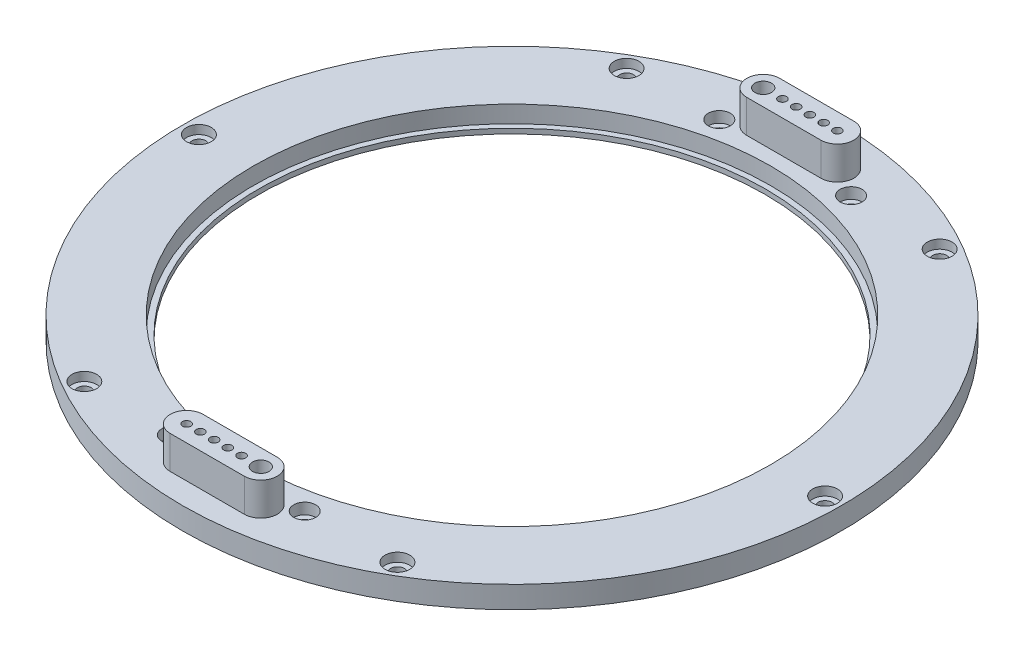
from build123d import *

# Parameters (mm, degrees)
SKETCH_1_R               = 60
SKETCH_1_R_2             = 47.1
EXTRUDE_1_DEPTH          = 4
SKETCH_2_R               = 47.1
SKETCH_2_R_2             = 46.1
EXTRUDE_2_DEPTH          = 0.9
SKETCH_3_R               = 1.5
SKETCH_3_R_2             = 0.75
CUT_EXTRUDE_1_DEPTH      = 85.947042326
SKETCH_4_R               = 1
CUT_EXTRUDE_2_DEPTH      = 85.947042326
SKETCH_6_R               = 2
CUT_EXTRUDE_3_DEPTH      = 2
SKETCH_7_R               = 1.25
CUT_EXTRUDE_4_DEPTH      = 85.947042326
SKETCH_8_R               = 2.25
CUT_EXTRUDE_5_DEPTH      = 1.6
EXTRUDE_START            = 6
SKETCH_9_R               = 0.75
SKETCH_9_R_2             = 1.5
EXTRUDE_3_DEPTH          = 6
PATTERN_CIRCULAR_1_COUNT = 2


with BuildPart() as part:
    # Sketch 1 → Extrude 1 (new body)
    with BuildSketch(Plane(origin=(0, 0, 0), x_dir=(1, 0, 0), z_dir=(0, 1, 0))):
        with Locations(Location((0, 0, 0), (0, 0, 270))):
            Circle(SKETCH_1_R)
        with Locations(Location((0, 0, 0), (0, 0, 270))):
            Circle(SKETCH_1_R_2, mode=Mode.SUBTRACT)
    extrude(amount=EXTRUDE_1_DEPTH)

    # Sketch 2 → Extrude 2 (add)
    with BuildSketch(Plane.XZ):
        with Locations(Location((0, 0, 0), (0, 0, 270))):
            Circle(SKETCH_2_R)
        with Locations(Location((0, 0, 0), (0, 0, 270))):
            Circle(SKETCH_2_R_2, mode=Mode.SUBTRACT)
    extrude(amount=-EXTRUDE_2_DEPTH)

    # Sketch 3 → Cut-Extrude 1 (cut, through all)
    with BuildSketch(Plane(origin=(0, 4, 0), x_dir=(1, 0, 0), z_dir=(0, 1, 0))):
        with Locations(Location((7, -52.73593463, 0), (0, 0, 270))):
            Circle(SKETCH_3_R)
        with Locations(Location((3.5, -52.73593463, 0), (0, 0, 270))):
            Circle(SKETCH_3_R_2)
        with Locations(Location((1, -52.73593463, 0), (0, 0, 270))):
            Circle(SKETCH_3_R_2)
        with Locations(Location((-1.5, -52.73593463, 0), (0, 0, 270))):
            Circle(SKETCH_3_R_2)
        with Locations(Location((-4, -52.73593463, 0), (0, 0, 270))):
            Circle(SKETCH_3_R_2)
        with Locations(Location((-6.5, -52.73593463, 0), (0, 0, 270))):
            Circle(SKETCH_3_R_2)
        with Locations(Location((6.5, 52.73593463, 0), (0, 0, 270))):
            Circle(SKETCH_3_R_2)
        with Locations(Location((4, 52.73593463, 0), (0, 0, 270))):
            Circle(SKETCH_3_R_2)
        with Locations(Location((1.5, 52.73593463, 0), (0, 0, 270))):
            Circle(SKETCH_3_R_2)
        with Locations(Location((-1, 52.73593463, 0), (0, 0, 270))):
            Circle(SKETCH_3_R_2)
        with Locations(Location((-3.5, 52.73593463, 0), (0, 0, 270))):
            Circle(SKETCH_3_R_2)
        with Locations(Location((-7, 52.73593463, 0), (0, 0, 270))):
            Circle(SKETCH_3_R)
    extrude(amount=-CUT_EXTRUDE_1_DEPTH, mode=Mode.SUBTRACT)

    # Sketch 4 → Cut-Extrude 2 (cut, through all)
    with BuildSketch(Plane.XZ):
        with Locations(Location((-12, -49.73593463, 0), (0, 0, 270))):
            Circle(SKETCH_4_R)
        with Locations(Location((12, -49.73593463, 0), (0, 0, 270))):
            Circle(SKETCH_4_R)
        with Locations(Location((-12, 49.73593463, 0), (0, 0, 270))):
            Circle(SKETCH_4_R)
        with Locations(Location((12, 49.73593463, 0), (0, 0, 270))):
            Circle(SKETCH_4_R)
    extrude(amount=-CUT_EXTRUDE_2_DEPTH, mode=Mode.SUBTRACT)

    # Sketch 6 → Cut-Extrude 3 (cut)
    with BuildSketch(Plane.XZ.offset(-4)):
        with Locations(Location((-12, -49.73593463, 0), (0, 0, 270))):
            Circle(SKETCH_6_R)
        with Locations(Location((12, -49.73593463, 0), (0, 0, 270))):
            Circle(SKETCH_6_R)
        with Locations(Location((-12, 49.73593463, 0), (0, 0, 270))):
            Circle(SKETCH_6_R)
        with Locations(Location((12, 49.73593463, 0), (0, 0, 270))):
            Circle(SKETCH_6_R)
    extrude(amount=CUT_EXTRUDE_3_DEPTH, mode=Mode.SUBTRACT)

    # Sketch 7 → Cut-Extrude 4 (cut, through all)
    with BuildSketch(Plane(origin=(0, 4, 0), x_dir=(1, 0, 0), z_dir=(0, 1, 0))):
        with Locations(Location((-57, 0, 0), (0, 0, 270))):
            Circle(SKETCH_7_R)
        with Locations(Location((-28.5, 49.363448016, 0), (0, 0, 270))):
            Circle(SKETCH_7_R)
        with Locations(Location((28.5, 49.363448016, 0), (0, 0, 270))):
            Circle(SKETCH_7_R)
        with Locations(Location((57, 0, 0), (0, 0, 270))):
            Circle(SKETCH_7_R)
        with Locations(Location((28.5, -49.363448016, 0), (0, 0, 270))):
            Circle(SKETCH_7_R)
        with Locations(Location((-28.5, -49.363448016, 0), (0, 0, 270))):
            Circle(SKETCH_7_R)
    extrude(amount=-CUT_EXTRUDE_4_DEPTH, mode=Mode.SUBTRACT)

    # Sketch 8 → Cut-Extrude 5 (cut)
    with BuildSketch(Plane(origin=(0, 4, 0), x_dir=(1, 0, 0), z_dir=(0, 1, 0))):
        with Locations(Location((-28.5, 49.363448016, 0), (0, 0, 270))):
            Circle(SKETCH_8_R)
        with Locations(Location((-57, 0, 0), (0, 0, 270))):
            Circle(SKETCH_8_R)
        with Locations(Location((-28.5, -49.363448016, 0), (0, 0, 270))):
            Circle(SKETCH_8_R)
        with Locations(Location((28.5, -49.363448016, 0), (0, 0, 270))):
            Circle(SKETCH_8_R)
        with Locations(Location((57, 0, 0), (0, 0, 270))):
            Circle(SKETCH_8_R)
        with Locations(Location((28.5, 49.363448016, 0), (0, 0, 270))):
            Circle(SKETCH_8_R)
    extrude(amount=-CUT_EXTRUDE_5_DEPTH, mode=Mode.SUBTRACT)

    # Sketch 9 → Extrude 3 (add)
    with BuildSketch(Plane(origin=(0, 4, 0), x_dir=(1, 0, 0), z_dir=(0, 1, 0)).offset(EXTRUDE_START)):
        with BuildLine():
            Line((-7, 55.73593463), (6.5, 55.73593463))
            ThreePointArc((6.5, 55.73593463), (9.5, 52.73593463), (6.5, 49.73593463))
            Line((6.5, 49.73593463), (-7, 49.73593463))
            ThreePointArc((-7, 49.73593463), (-10, 52.73593463), (-7, 55.73593463))
        make_face()
        with Locations(Location((6.5, 52.73593463, 0), (0, 0, 270))):
            Circle(SKETCH_9_R, mode=Mode.SUBTRACT)
        with Locations(Location((4, 52.73593463, 0), (0, 0, 270))):
            Circle(SKETCH_9_R, mode=Mode.SUBTRACT)
        with Locations(Location((1.5, 52.73593463, 0), (0, 0, 270))):
            Circle(SKETCH_9_R, mode=Mode.SUBTRACT)
        with Locations(Location((-1, 52.73593463, 0), (0, 0, 270))):
            Circle(SKETCH_9_R, mode=Mode.SUBTRACT)
        with Locations(Location((-3.5, 52.73593463, 0), (0, 0, 270))):
            Circle(SKETCH_9_R, mode=Mode.SUBTRACT)
        with Locations(Location((-7, 52.73593463, 0), (0, 0, 270))):
            Circle(SKETCH_9_R_2, mode=Mode.SUBTRACT)
    extrude_3 = extrude(amount=-EXTRUDE_3_DEPTH)

    # Pattern Circular 1: Extrude 3 ×2 about axis
    pattern_circular_1_axis = Axis((0, 0, 0), (0, 1, 0))
    for i in range(1, PATTERN_CIRCULAR_1_COUNT):
        add(extrude_3.rotate(pattern_circular_1_axis, i * 360 / PATTERN_CIRCULAR_1_COUNT))


solid = part.part
